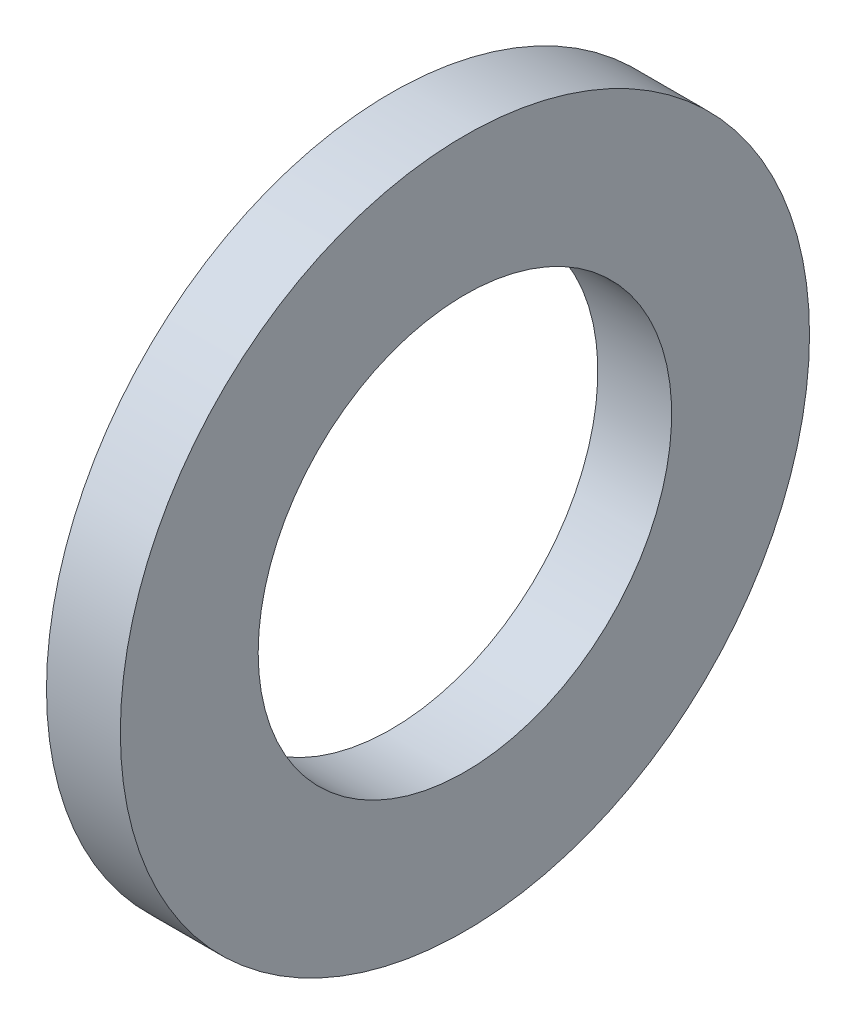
ISO-10303-21;
HEADER;
FILE_DESCRIPTION(('STEP AP214'),'2;1');
FILE_NAME('part.step','',(''),(''),'','','');
FILE_SCHEMA(('AUTOMOTIVE_DESIGN { 1 0 10303 214 1 1 1 1 }'));
ENDSEC;
DATA;
#1=APPLICATION_CONTEXT('core data for automotive mechanical design processes');
#2=APPLICATION_PROTOCOL_DEFINITION('international standard','automotive_design',2000,#1);
#3=PRODUCT_CONTEXT('',#1,'mechanical');
#4=PRODUCT('Part','Part','',(#3));
#5=PRODUCT_RELATED_PRODUCT_CATEGORY('part','',(#4));
#6=PRODUCT_DEFINITION_FORMATION('','',#4);
#7=PRODUCT_DEFINITION_CONTEXT('part definition',#1,'design');
#8=PRODUCT_DEFINITION('design','',#6,#7);
#9=PRODUCT_DEFINITION_SHAPE('','',#8);
#10=(LENGTH_UNIT() NAMED_UNIT(*) SI_UNIT(.MILLI.,.METRE.));
#11=(NAMED_UNIT(*) PLANE_ANGLE_UNIT() SI_UNIT($,.RADIAN.));
#12=(NAMED_UNIT(*) SI_UNIT($,.STERADIAN.) SOLID_ANGLE_UNIT());
#13=UNCERTAINTY_MEASURE_WITH_UNIT(LENGTH_MEASURE(1.E-05),#10,'distance_accuracy_value','');
#14=(GEOMETRIC_REPRESENTATION_CONTEXT(3) GLOBAL_UNCERTAINTY_ASSIGNED_CONTEXT((#13)) GLOBAL_UNIT_ASSIGNED_CONTEXT((#10,
#11,#12)) REPRESENTATION_CONTEXT('',''));
#15=CARTESIAN_POINT('',(0.,0.,0.));
#16=DIRECTION('',(0.,0.,1.));
#17=DIRECTION('',(1.,0.,0.));
#18=AXIS2_PLACEMENT_3D('',#15,#16,#17);
#19=CARTESIAN_POINT('',(0.,0.,-7.));
#20=DIRECTION('',(1.,0.,0.));
#21=DIRECTION('',(0.,0.,-1.));
#22=AXIS2_PLACEMENT_3D('',#19,#20,#21);
#23=PLANE('',#22);
#24=CARTESIAN_POINT('',(0.,0.,0.));
#25=DIRECTION('',(-1.,0.,0.));
#26=DIRECTION('',(0.,0.,1.));
#27=AXIS2_PLACEMENT_3D('',#24,#25,#26);
#28=CIRCLE('',#27,4.2);
#29=CARTESIAN_POINT('',(0.,0.,4.2));
#30=VERTEX_POINT('',#29);
#31=EDGE_CURVE('E10',#30,#30,#28,.T.);
#32=ORIENTED_EDGE('',*,*,#31,.F.);
#33=EDGE_LOOP('',(#32));
#34=FACE_BOUND('',#33,.T.);
#35=CARTESIAN_POINT('',(0.,0.,0.));
#36=DIRECTION('',(-1.,0.,0.));
#37=DIRECTION('',(0.,0.,1.));
#38=AXIS2_PLACEMENT_3D('',#35,#36,#37);
#39=CIRCLE('',#38,7.);
#40=CARTESIAN_POINT('',(0.,0.,7.));
#41=VERTEX_POINT('',#40);
#42=EDGE_CURVE('E44',#41,#41,#39,.T.);
#43=ORIENTED_EDGE('',*,*,#42,.T.);
#44=EDGE_LOOP('',(#43));
#45=FACE_BOUND('',#44,.T.);
#46=ADVANCED_FACE('F30',(#34,#45),#23,.F.);
#47=CARTESIAN_POINT('',(0.,0.,0.));
#48=DIRECTION('',(-1.,0.,0.));
#49=DIRECTION('',(0.,0.,1.));
#50=AXIS2_PLACEMENT_3D('',#47,#48,#49);
#51=CYLINDRICAL_SURFACE('',#50,4.2);
#52=CARTESIAN_POINT('',(1.5,0.,0.));
#53=DIRECTION('',(-1.,0.,0.));
#54=DIRECTION('',(0.,0.,1.));
#55=AXIS2_PLACEMENT_3D('',#52,#53,#54);
#56=CIRCLE('',#55,4.2);
#57=CARTESIAN_POINT('',(1.5,0.,4.2));
#58=VERTEX_POINT('',#57);
#59=EDGE_CURVE('E36',#58,#58,#56,.T.);
#60=ORIENTED_EDGE('',*,*,#59,.F.);
#61=EDGE_LOOP('',(#60));
#62=FACE_BOUND('',#61,.T.);
#63=ORIENTED_EDGE('',*,*,#31,.T.);
#64=EDGE_LOOP('',(#63));
#65=FACE_BOUND('',#64,.T.);
#66=ADVANCED_FACE('F59',(#62,#65),#51,.F.);
#67=CARTESIAN_POINT('',(1.5,0.,-7.));
#68=DIRECTION('',(-1.,0.,0.));
#69=DIRECTION('',(0.,0.,1.));
#70=AXIS2_PLACEMENT_3D('',#67,#68,#69);
#71=PLANE('',#70);
#72=CARTESIAN_POINT('',(1.5,0.,0.));
#73=DIRECTION('',(-1.,0.,0.));
#74=DIRECTION('',(0.,0.,1.));
#75=AXIS2_PLACEMENT_3D('',#72,#73,#74);
#76=CIRCLE('',#75,7.);
#77=CARTESIAN_POINT('',(1.5,0.,7.));
#78=VERTEX_POINT('',#77);
#79=EDGE_CURVE('E40',#78,#78,#76,.T.);
#80=ORIENTED_EDGE('',*,*,#79,.F.);
#81=EDGE_LOOP('',(#80));
#82=FACE_BOUND('',#81,.T.);
#83=ORIENTED_EDGE('',*,*,#59,.T.);
#84=EDGE_LOOP('',(#83));
#85=FACE_BOUND('',#84,.T.);
#86=ADVANCED_FACE('F54',(#82,#85),#71,.F.);
#87=CARTESIAN_POINT('',(0.,0.,0.));
#88=DIRECTION('',(-1.,0.,0.));
#89=DIRECTION('',(0.,0.,1.));
#90=AXIS2_PLACEMENT_3D('',#87,#88,#89);
#91=CYLINDRICAL_SURFACE('',#90,7.);
#92=ORIENTED_EDGE('',*,*,#42,.F.);
#93=EDGE_LOOP('',(#92));
#94=FACE_BOUND('',#93,.T.);
#95=ORIENTED_EDGE('',*,*,#79,.T.);
#96=EDGE_LOOP('',(#95));
#97=FACE_BOUND('',#96,.T.);
#98=ADVANCED_FACE('F51',(#94,#97),#91,.T.);
#99=CLOSED_SHELL('',(#46,#66,#86,#98));
#100=MANIFOLD_SOLID_BREP('B2',#99);
#101=ADVANCED_BREP_SHAPE_REPRESENTATION('',(#18,#100),#14);
#102=SHAPE_DEFINITION_REPRESENTATION(#9,#101);
ENDSEC;
END-ISO-10303-21;
